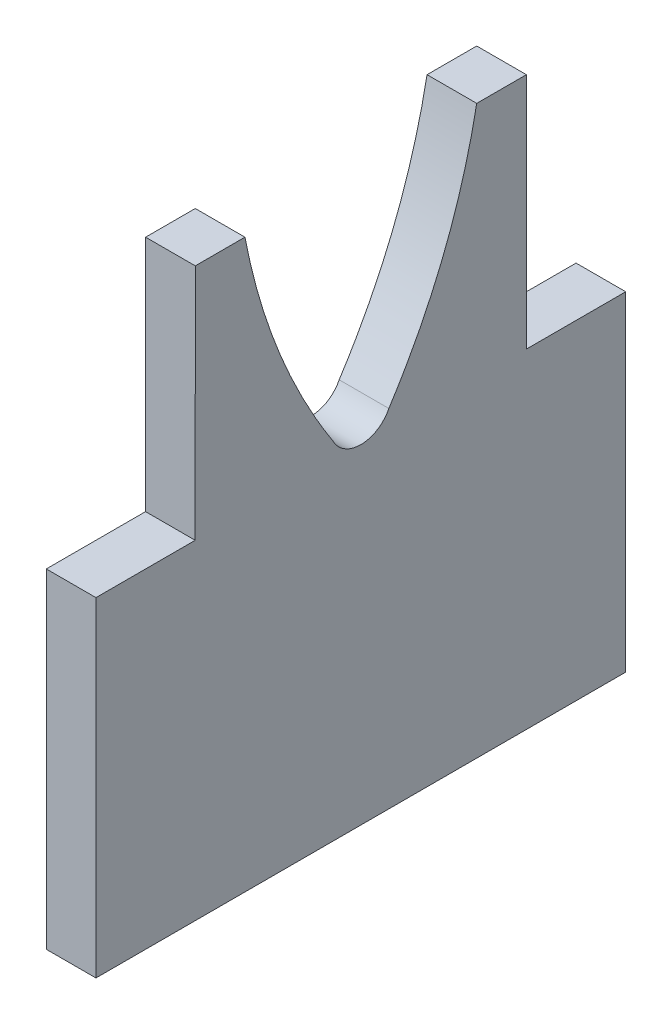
from build123d import *

# Parameters (mm, degrees)
SKETCH1_W           = 3
SKETCH1_H           = 19.898661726
BOSS_EXTRUDE1_DEPTH = 32
BOSS_EXTRUDE2_DEPTH = 3


with BuildPart() as part:
    # Sketch1 → Boss-Extrude1 (new body)
    with BuildSketch(Plane.XY):
        with Locations((198.278337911, 37.580135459)):
            Rectangle(SKETCH1_W, SKETCH1_H)
    extrude(amount=-BOSS_EXTRUDE1_DEPTH)

    # Sketch2 → Boss-Extrude2 (add)
    with BuildSketch(Plane.ZY.offset(-196.778337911)):
        with BuildLine():
            ThreePointArc((-14.307683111, 48.577953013), (-15.004602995, 47.81283018), (-16, 47.529466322))
            Line((-16, 47.529466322), (-5.996232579, 47.529466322))
            Line((-5.996232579, 47.529466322), (-6, 61.884414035))
            Line((-6, 61.884414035), (-9, 61.884414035))
            add(Edge.make_bspline(
                [(-9, 61.884414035), (-10.373450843, 54.671230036), (-14.307683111, 48.577953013)],
                knots=[0, 0, 0, 1, 1, 1], degree=2))
        make_face()
        with BuildLine():
            Line((-26, 61.884414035), (-26.003767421, 47.529466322))
            Line((-26.003767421, 47.529466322), (-16, 47.529466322))
            ThreePointArc((-16, 47.529466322), (-16.995397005, 47.81283018), (-17.692316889, 48.577953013))
            add(Edge.make_bspline(
                [(-23, 61.884414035), (-21.626549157, 54.671230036), (-17.692316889, 48.577953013)],
                knots=[0, 0, 0, 1, 1, 1], degree=2))
            Line((-23, 61.884414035), (-26, 61.884414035))
        make_face()
    extrude(amount=-BOSS_EXTRUDE2_DEPTH)


solid = part.part
